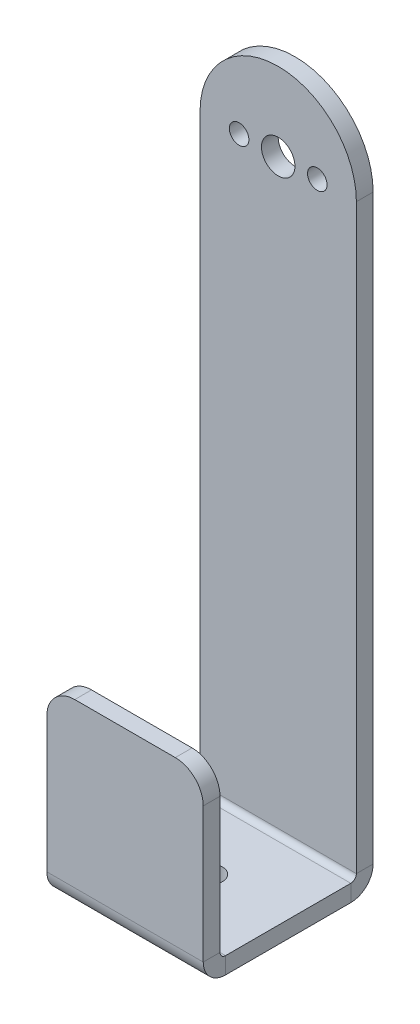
ISO-10303-21;
HEADER;
FILE_DESCRIPTION(('STEP AP214'),'2;1');
FILE_NAME('part.step','',(''),(''),'','','');
FILE_SCHEMA(('AUTOMOTIVE_DESIGN { 1 0 10303 214 1 1 1 1 }'));
ENDSEC;
DATA;
#1=APPLICATION_CONTEXT('core data for automotive mechanical design processes');
#2=APPLICATION_PROTOCOL_DEFINITION('international standard','automotive_design',2000,#1);
#3=PRODUCT_CONTEXT('',#1,'mechanical');
#4=PRODUCT('Part','Part','',(#3));
#5=PRODUCT_RELATED_PRODUCT_CATEGORY('part','',(#4));
#6=PRODUCT_DEFINITION_FORMATION('','',#4);
#7=PRODUCT_DEFINITION_CONTEXT('part definition',#1,'design');
#8=PRODUCT_DEFINITION('design','',#6,#7);
#9=PRODUCT_DEFINITION_SHAPE('','',#8);
#10=(LENGTH_UNIT() NAMED_UNIT(*) SI_UNIT(.MILLI.,.METRE.));
#11=(NAMED_UNIT(*) PLANE_ANGLE_UNIT() SI_UNIT($,.RADIAN.));
#12=(NAMED_UNIT(*) SI_UNIT($,.STERADIAN.) SOLID_ANGLE_UNIT());
#13=UNCERTAINTY_MEASURE_WITH_UNIT(LENGTH_MEASURE(1.E-05),#10,'distance_accuracy_value','');
#14=(GEOMETRIC_REPRESENTATION_CONTEXT(3) GLOBAL_UNCERTAINTY_ASSIGNED_CONTEXT((#13)) GLOBAL_UNIT_ASSIGNED_CONTEXT((#10,
#11,#12)) REPRESENTATION_CONTEXT('',''));
#15=CARTESIAN_POINT('',(0.,0.,0.));
#16=DIRECTION('',(0.,0.,1.));
#17=DIRECTION('',(1.,0.,0.));
#18=AXIS2_PLACEMENT_3D('',#15,#16,#17);
#19=CARTESIAN_POINT('',(14.,53.785421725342,-101.785421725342));
#20=DIRECTION('',(0.,1.,0.));
#21=DIRECTION('',(1.,0.,0.));
#22=AXIS2_PLACEMENT_3D('',#19,#20,#21);
#23=PLANE('',#22);
#24=CARTESIAN_POINT('',(14.,53.7854217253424,15.2145782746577));
#25=DIRECTION('',(0.,1.,0.));
#26=DIRECTION('',(1.,0.,0.));
#27=AXIS2_PLACEMENT_3D('',#24,#25,#26);
#28=CIRCLE('',#27,2.25);
#29=CARTESIAN_POINT('',(16.25,53.7854217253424,15.2145782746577));
#30=VERTEX_POINT('',#29);
#31=EDGE_CURVE('E250',#30,#30,#28,.T.);
#32=ORIENTED_EDGE('',*,*,#31,.F.);
#33=EDGE_LOOP('',(#32));
#34=FACE_BOUND('',#33,.T.);
#35=DIRECTION('',(0.,0.,1.));
#36=VECTOR('',#35,1.);
#37=CARTESIAN_POINT('',(0.,53.7854217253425,57.2145782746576));
#38=LINE('',#37,#36);
#39=CARTESIAN_POINT('',(0.,53.7854217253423,4.));
#40=VERTEX_POINT('',#39);
#41=CARTESIAN_POINT('',(0.,53.7854217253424,26.4291565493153));
#42=VERTEX_POINT('',#41);
#43=EDGE_CURVE('E280',#40,#42,#38,.T.);
#44=ORIENTED_EDGE('',*,*,#43,.T.);
#45=DIRECTION('',(1.,0.,0.));
#46=VECTOR('',#45,1.);
#47=CARTESIAN_POINT('',(14.,53.7854217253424,26.4291565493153));
#48=LINE('',#47,#46);
#49=CARTESIAN_POINT('',(28.,53.7854217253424,26.4291565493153));
#50=VERTEX_POINT('',#49);
#51=EDGE_CURVE('E179',#42,#50,#48,.T.);
#52=ORIENTED_EDGE('',*,*,#51,.T.);
#53=DIRECTION('',(0.,0.,-1.));
#54=VECTOR('',#53,1.);
#55=CARTESIAN_POINT('',(28.,53.7854217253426,57.2145782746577));
#56=LINE('',#55,#54);
#57=CARTESIAN_POINT('',(28.,53.7854217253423,4.));
#58=VERTEX_POINT('',#57);
#59=EDGE_CURVE('E260',#50,#58,#56,.T.);
#60=ORIENTED_EDGE('',*,*,#59,.T.);
#61=DIRECTION('',(-1.,0.,0.));
#62=VECTOR('',#61,1.);
#63=CARTESIAN_POINT('',(14.,53.7854217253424,4.00000000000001));
#64=LINE('',#63,#62);
#65=EDGE_CURVE('E256',#58,#40,#64,.T.);
#66=ORIENTED_EDGE('',*,*,#65,.T.);
#67=EDGE_LOOP('',(#44,#52,#60,#66));
#68=FACE_BOUND('',#67,.T.);
#69=ADVANCED_FACE('F44',(#34,#68),#23,.T.);
#70=CARTESIAN_POINT('',(14.,50.785421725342,-101.785421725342));
#71=DIRECTION('',(0.,1.,0.));
#72=DIRECTION('',(1.,0.,0.));
#73=AXIS2_PLACEMENT_3D('',#70,#71,#72);
#74=PLANE('',#73);
#75=DIRECTION('',(1.,0.,0.));
#76=VECTOR('',#75,1.);
#77=CARTESIAN_POINT('',(14.,50.7854217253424,26.4291565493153));
#78=LINE('',#77,#76);
#79=CARTESIAN_POINT('',(0.,50.7854217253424,26.4291565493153));
#80=VERTEX_POINT('',#79);
#81=CARTESIAN_POINT('',(28.,50.7854217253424,26.4291565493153));
#82=VERTEX_POINT('',#81);
#83=EDGE_CURVE('E270',#80,#82,#78,.T.);
#84=ORIENTED_EDGE('',*,*,#83,.F.);
#85=DIRECTION('',(0.,0.,1.));
#86=VECTOR('',#85,1.);
#87=CARTESIAN_POINT('',(0.,50.7854217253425,57.2145782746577));
#88=LINE('',#87,#86);
#89=CARTESIAN_POINT('',(0.,50.7854217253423,4.));
#90=VERTEX_POINT('',#89);
#91=EDGE_CURVE('E253',#90,#80,#88,.T.);
#92=ORIENTED_EDGE('',*,*,#91,.F.);
#93=DIRECTION('',(-1.,0.,0.));
#94=VECTOR('',#93,1.);
#95=CARTESIAN_POINT('',(14.,50.7854217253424,4.));
#96=LINE('',#95,#94);
#97=CARTESIAN_POINT('',(28.,50.7854217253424,4.));
#98=VERTEX_POINT('',#97);
#99=EDGE_CURVE('E262',#98,#90,#96,.T.);
#100=ORIENTED_EDGE('',*,*,#99,.F.);
#101=DIRECTION('',(0.,0.,-1.));
#102=VECTOR('',#101,1.);
#103=CARTESIAN_POINT('',(28.,50.7854217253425,57.2145782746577));
#104=LINE('',#103,#102);
#105=EDGE_CURVE('E277',#82,#98,#104,.T.);
#106=ORIENTED_EDGE('',*,*,#105,.F.);
#107=EDGE_LOOP('',(#84,#92,#100,#106));
#108=FACE_BOUND('',#107,.T.);
#109=CARTESIAN_POINT('',(14.,50.7854217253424,15.2145782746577));
#110=DIRECTION('',(0.,1.,0.));
#111=DIRECTION('',(1.,0.,0.));
#112=AXIS2_PLACEMENT_3D('',#109,#110,#111);
#113=CIRCLE('',#112,2.25);
#114=CARTESIAN_POINT('',(16.25,50.7854217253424,15.2145782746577));
#115=VERTEX_POINT('',#114);
#116=EDGE_CURVE('E204',#115,#115,#113,.T.);
#117=ORIENTED_EDGE('',*,*,#116,.T.);
#118=EDGE_LOOP('',(#117));
#119=FACE_BOUND('',#118,.T.);
#120=ADVANCED_FACE('F326',(#108,#119),#74,.F.);
#121=CARTESIAN_POINT('',(0.,53.7854217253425,57.2145782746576));
#122=DIRECTION('',(1.,0.,0.));
#123=DIRECTION('',(0.,-1.,0.));
#124=AXIS2_PLACEMENT_3D('',#121,#122,#123);
#125=PLANE('',#124);
#126=DIRECTION('',(0.,-1.,0.));
#127=VECTOR('',#126,1.);
#128=CARTESIAN_POINT('',(0.,53.7854217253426,26.4291565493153));
#129=LINE('',#128,#127);
#130=EDGE_CURVE('E268',#42,#80,#129,.T.);
#131=ORIENTED_EDGE('',*,*,#130,.F.);
#132=ORIENTED_EDGE('',*,*,#43,.F.);
#133=DIRECTION('',(0.,1.,0.));
#134=VECTOR('',#133,1.);
#135=CARTESIAN_POINT('',(0.,53.7854217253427,4.));
#136=LINE('',#135,#134);
#137=EDGE_CURVE('E264',#90,#40,#136,.T.);
#138=ORIENTED_EDGE('',*,*,#137,.F.);
#139=ORIENTED_EDGE('',*,*,#91,.T.);
#140=EDGE_LOOP('',(#131,#132,#138,#139));
#141=FACE_BOUND('',#140,.T.);
#142=ADVANCED_FACE('F334',(#141),#125,.F.);
#143=CARTESIAN_POINT('',(28.,53.7854217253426,57.2145782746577));
#144=DIRECTION('',(-1.,0.,0.));
#145=DIRECTION('',(0.,0.,1.));
#146=AXIS2_PLACEMENT_3D('',#143,#144,#145);
#147=PLANE('',#146);
#148=DIRECTION('',(0.,1.,0.));
#149=VECTOR('',#148,1.);
#150=CARTESIAN_POINT('',(28.,53.7854217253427,26.4291565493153));
#151=LINE('',#150,#149);
#152=EDGE_CURVE('E273',#82,#50,#151,.T.);
#153=ORIENTED_EDGE('',*,*,#152,.F.);
#154=ORIENTED_EDGE('',*,*,#105,.T.);
#155=DIRECTION('',(0.,-1.,0.));
#156=VECTOR('',#155,1.);
#157=CARTESIAN_POINT('',(28.,53.7854217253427,4.));
#158=LINE('',#157,#156);
#159=EDGE_CURVE('E259',#58,#98,#158,.T.);
#160=ORIENTED_EDGE('',*,*,#159,.F.);
#161=ORIENTED_EDGE('',*,*,#59,.F.);
#162=EDGE_LOOP('',(#153,#154,#160,#161));
#163=FACE_BOUND('',#162,.T.);
#164=ADVANCED_FACE('F366',(#163),#147,.F.);
#165=CARTESIAN_POINT('',(14.,53.7854217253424,15.2145782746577));
#166=DIRECTION('',(0.,-1.,0.));
#167=DIRECTION('',(-1.,0.,0.));
#168=AXIS2_PLACEMENT_3D('',#165,#166,#167);
#169=CYLINDRICAL_SURFACE('',#168,2.25);
#170=ORIENTED_EDGE('',*,*,#31,.T.);
#171=EDGE_LOOP('',(#170));
#172=FACE_BOUND('',#171,.T.);
#173=ORIENTED_EDGE('',*,*,#116,.F.);
#174=EDGE_LOOP('',(#173));
#175=FACE_BOUND('',#174,.T.);
#176=ADVANCED_FACE('F368',(#172,#175),#169,.F.);
#177=CARTESIAN_POINT('',(6.99999999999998,159.,3.));
#178=DIRECTION('',(0.,0.,-1.));
#179=DIRECTION('',(-1.,0.,0.));
#180=AXIS2_PLACEMENT_3D('',#177,#178,#179);
#181=CYLINDRICAL_SURFACE('',#180,1.75);
#182=CARTESIAN_POINT('',(6.99999999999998,159.,3.));
#183=DIRECTION('',(0.,0.,1.));
#184=DIRECTION('',(1.,0.,0.));
#185=AXIS2_PLACEMENT_3D('',#182,#183,#184);
#186=CIRCLE('',#185,1.75);
#187=CARTESIAN_POINT('',(8.74999999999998,159.,3.));
#188=VERTEX_POINT('',#187);
#189=EDGE_CURVE('E246',#188,#188,#186,.T.);
#190=ORIENTED_EDGE('',*,*,#189,.T.);
#191=EDGE_LOOP('',(#190));
#192=FACE_BOUND('',#191,.T.);
#193=CARTESIAN_POINT('',(6.99999999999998,159.,0.));
#194=DIRECTION('',(0.,0.,1.));
#195=DIRECTION('',(1.,0.,0.));
#196=AXIS2_PLACEMENT_3D('',#193,#194,#195);
#197=CIRCLE('',#196,1.75);
#198=CARTESIAN_POINT('',(8.74999999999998,159.,0.));
#199=VERTEX_POINT('',#198);
#200=EDGE_CURVE('E220',#199,#199,#197,.T.);
#201=ORIENTED_EDGE('',*,*,#200,.F.);
#202=EDGE_LOOP('',(#201));
#203=FACE_BOUND('',#202,.T.);
#204=ADVANCED_FACE('F374',(#192,#203),#181,.F.);
#205=CARTESIAN_POINT('',(14.,159.,3.));
#206=DIRECTION('',(0.,0.,-1.));
#207=DIRECTION('',(-1.,0.,0.));
#208=AXIS2_PLACEMENT_3D('',#205,#206,#207);
#209=CYLINDRICAL_SURFACE('',#208,3.);
#210=CARTESIAN_POINT('',(14.,159.,3.));
#211=DIRECTION('',(0.,0.,1.));
#212=DIRECTION('',(1.,0.,0.));
#213=AXIS2_PLACEMENT_3D('',#210,#211,#212);
#214=CIRCLE('',#213,3.);
#215=CARTESIAN_POINT('',(17.,159.,3.));
#216=VERTEX_POINT('',#215);
#217=EDGE_CURVE('E243',#216,#216,#214,.T.);
#218=ORIENTED_EDGE('',*,*,#217,.T.);
#219=EDGE_LOOP('',(#218));
#220=FACE_BOUND('',#219,.T.);
#221=CARTESIAN_POINT('',(14.,159.,0.));
#222=DIRECTION('',(0.,0.,1.));
#223=DIRECTION('',(1.,0.,0.));
#224=AXIS2_PLACEMENT_3D('',#221,#222,#223);
#225=CIRCLE('',#224,3.);
#226=CARTESIAN_POINT('',(17.,159.,0.));
#227=VERTEX_POINT('',#226);
#228=EDGE_CURVE('E217',#227,#227,#225,.T.);
#229=ORIENTED_EDGE('',*,*,#228,.F.);
#230=EDGE_LOOP('',(#229));
#231=FACE_BOUND('',#230,.T.);
#232=ADVANCED_FACE('F404',(#220,#231),#209,.F.);
#233=CARTESIAN_POINT('',(21.,159.,3.));
#234=DIRECTION('',(0.,0.,-1.));
#235=DIRECTION('',(-1.,0.,0.));
#236=AXIS2_PLACEMENT_3D('',#233,#234,#235);
#237=CYLINDRICAL_SURFACE('',#236,1.75);
#238=CARTESIAN_POINT('',(21.,159.,3.));
#239=DIRECTION('',(0.,0.,1.));
#240=DIRECTION('',(1.,0.,0.));
#241=AXIS2_PLACEMENT_3D('',#238,#239,#240);
#242=CIRCLE('',#241,1.75);
#243=CARTESIAN_POINT('',(22.75,159.,3.));
#244=VERTEX_POINT('',#243);
#245=EDGE_CURVE('E240',#244,#244,#242,.T.);
#246=ORIENTED_EDGE('',*,*,#245,.T.);
#247=EDGE_LOOP('',(#246));
#248=FACE_BOUND('',#247,.T.);
#249=CARTESIAN_POINT('',(21.,159.,0.));
#250=DIRECTION('',(0.,0.,1.));
#251=DIRECTION('',(1.,0.,0.));
#252=AXIS2_PLACEMENT_3D('',#249,#250,#251);
#253=CIRCLE('',#252,1.75);
#254=CARTESIAN_POINT('',(22.75,159.,0.));
#255=VERTEX_POINT('',#254);
#256=EDGE_CURVE('E214',#255,#255,#253,.T.);
#257=ORIENTED_EDGE('',*,*,#256,.F.);
#258=EDGE_LOOP('',(#257));
#259=FACE_BOUND('',#258,.T.);
#260=ADVANCED_FACE('F400',(#248,#259),#237,.F.);
#261=CARTESIAN_POINT('',(14.,159.,3.));
#262=DIRECTION('',(0.,0.,-1.));
#263=DIRECTION('',(-1.,0.,0.));
#264=AXIS2_PLACEMENT_3D('',#261,#262,#263);
#265=CYLINDRICAL_SURFACE('',#264,14.);
#266=CARTESIAN_POINT('',(14.,159.,0.));
#267=DIRECTION('',(0.,0.,1.));
#268=DIRECTION('',(1.,0.,0.));
#269=AXIS2_PLACEMENT_3D('',#266,#267,#268);
#270=CIRCLE('',#269,14.);
#271=CARTESIAN_POINT('',(28.,159.,0.));
#272=VERTEX_POINT('',#271);
#273=CARTESIAN_POINT('',(0.,159.,0.));
#274=VERTEX_POINT('',#273);
#275=EDGE_CURVE('E238',#272,#274,#270,.T.);
#276=ORIENTED_EDGE('',*,*,#275,.T.);
#277=DIRECTION('',(0.,0.,-1.));
#278=VECTOR('',#277,1.);
#279=CARTESIAN_POINT('',(0.,159.,3.));
#280=LINE('',#279,#278);
#281=CARTESIAN_POINT('',(0.,159.,3.));
#282=VERTEX_POINT('',#281);
#283=EDGE_CURVE('E201',#282,#274,#280,.T.);
#284=ORIENTED_EDGE('',*,*,#283,.F.);
#285=CARTESIAN_POINT('',(14.,159.,3.));
#286=DIRECTION('',(0.,0.,1.));
#287=DIRECTION('',(1.,0.,0.));
#288=AXIS2_PLACEMENT_3D('',#285,#286,#287);
#289=CIRCLE('',#288,14.);
#290=CARTESIAN_POINT('',(28.,159.,3.));
#291=VERTEX_POINT('',#290);
#292=EDGE_CURVE('E231',#291,#282,#289,.T.);
#293=ORIENTED_EDGE('',*,*,#292,.F.);
#294=DIRECTION('',(0.,0.,-1.));
#295=VECTOR('',#294,1.);
#296=CARTESIAN_POINT('',(28.,159.,3.));
#297=LINE('',#296,#295);
#298=EDGE_CURVE('E235',#291,#272,#297,.T.);
#299=ORIENTED_EDGE('',*,*,#298,.T.);
#300=EDGE_LOOP('',(#276,#284,#293,#299));
#301=FACE_BOUND('',#300,.T.);
#302=ADVANCED_FACE('F397',(#301),#265,.T.);
#303=CARTESIAN_POINT('',(14.,159.,3.));
#304=DIRECTION('',(0.,0.,1.));
#305=DIRECTION('',(1.,0.,0.));
#306=AXIS2_PLACEMENT_3D('',#303,#304,#305);
#307=PLANE('',#306);
#308=DIRECTION('',(-1.,0.,0.));
#309=VECTOR('',#308,1.);
#310=CARTESIAN_POINT('',(14.,54.7854217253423,3.));
#311=LINE('',#310,#309);
#312=CARTESIAN_POINT('',(28.,54.7854217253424,3.));
#313=VERTEX_POINT('',#312);
#314=CARTESIAN_POINT('',(0.,54.7854217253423,3.));
#315=VERTEX_POINT('',#314);
#316=EDGE_CURVE('E197',#313,#315,#311,.T.);
#317=ORIENTED_EDGE('',*,*,#316,.F.);
#318=DIRECTION('',(0.,1.,0.));
#319=VECTOR('',#318,1.);
#320=CARTESIAN_POINT('',(28.,0.,3.));
#321=LINE('',#320,#319);
#322=EDGE_CURVE('E233',#313,#291,#321,.T.);
#323=ORIENTED_EDGE('',*,*,#322,.T.);
#324=ORIENTED_EDGE('',*,*,#292,.T.);
#325=DIRECTION('',(0.,-1.,0.));
#326=VECTOR('',#325,1.);
#327=CARTESIAN_POINT('',(0.,0.,3.));
#328=LINE('',#327,#326);
#329=EDGE_CURVE('E228',#282,#315,#328,.T.);
#330=ORIENTED_EDGE('',*,*,#329,.T.);
#331=EDGE_LOOP('',(#317,#323,#324,#330));
#332=FACE_BOUND('',#331,.T.);
#333=ORIENTED_EDGE('',*,*,#245,.F.);
#334=EDGE_LOOP('',(#333));
#335=FACE_BOUND('',#334,.T.);
#336=ORIENTED_EDGE('',*,*,#217,.F.);
#337=EDGE_LOOP('',(#336));
#338=FACE_BOUND('',#337,.T.);
#339=ORIENTED_EDGE('',*,*,#189,.F.);
#340=EDGE_LOOP('',(#339));
#341=FACE_BOUND('',#340,.T.);
#342=ADVANCED_FACE('F356',(#332,#335,#338,#341),#307,.T.);
#343=CARTESIAN_POINT('',(28.,0.,3.));
#344=DIRECTION('',(-1.,0.,0.));
#345=DIRECTION('',(0.,-1.,0.));
#346=AXIS2_PLACEMENT_3D('',#343,#344,#345);
#347=PLANE('',#346);
#348=ORIENTED_EDGE('',*,*,#322,.F.);
#349=DIRECTION('',(0.,0.,-1.));
#350=VECTOR('',#349,1.);
#351=CARTESIAN_POINT('',(28.,54.7854217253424,3.00000000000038));
#352=LINE('',#351,#350);
#353=CARTESIAN_POINT('',(28.,54.7854217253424,0.));
#354=VERTEX_POINT('',#353);
#355=EDGE_CURVE('E225',#313,#354,#352,.T.);
#356=ORIENTED_EDGE('',*,*,#355,.T.);
#357=DIRECTION('',(0.,1.,0.));
#358=VECTOR('',#357,1.);
#359=CARTESIAN_POINT('',(28.,0.,0.));
#360=LINE('',#359,#358);
#361=EDGE_CURVE('E223',#354,#272,#360,.T.);
#362=ORIENTED_EDGE('',*,*,#361,.T.);
#363=ORIENTED_EDGE('',*,*,#298,.F.);
#364=EDGE_LOOP('',(#348,#356,#362,#363));
#365=FACE_BOUND('',#364,.T.);
#366=ADVANCED_FACE('F351',(#365),#347,.F.);
#367=CARTESIAN_POINT('',(14.,159.,0.));
#368=DIRECTION('',(0.,0.,1.));
#369=DIRECTION('',(1.,0.,0.));
#370=AXIS2_PLACEMENT_3D('',#367,#368,#369);
#371=PLANE('',#370);
#372=ORIENTED_EDGE('',*,*,#200,.T.);
#373=EDGE_LOOP('',(#372));
#374=FACE_BOUND('',#373,.T.);
#375=ORIENTED_EDGE('',*,*,#228,.T.);
#376=EDGE_LOOP('',(#375));
#377=FACE_BOUND('',#376,.T.);
#378=ORIENTED_EDGE('',*,*,#256,.T.);
#379=EDGE_LOOP('',(#378));
#380=FACE_BOUND('',#379,.T.);
#381=ORIENTED_EDGE('',*,*,#361,.F.);
#382=DIRECTION('',(-1.,0.,0.));
#383=VECTOR('',#382,1.);
#384=CARTESIAN_POINT('',(14.,54.7854217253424,0.));
#385=LINE('',#384,#383);
#386=CARTESIAN_POINT('',(0.,54.7854217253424,0.));
#387=VERTEX_POINT('',#386);
#388=EDGE_CURVE('E211',#354,#387,#385,.T.);
#389=ORIENTED_EDGE('',*,*,#388,.T.);
#390=DIRECTION('',(0.,-1.,0.));
#391=VECTOR('',#390,1.);
#392=CARTESIAN_POINT('',(0.,0.,0.));
#393=LINE('',#392,#391);
#394=EDGE_CURVE('E208',#274,#387,#393,.T.);
#395=ORIENTED_EDGE('',*,*,#394,.F.);
#396=ORIENTED_EDGE('',*,*,#275,.F.);
#397=EDGE_LOOP('',(#381,#389,#395,#396));
#398=FACE_BOUND('',#397,.T.);
#399=ADVANCED_FACE('F389',(#374,#377,#380,#398),#371,.F.);
#400=CARTESIAN_POINT('',(0.,0.,3.));
#401=DIRECTION('',(1.,0.,0.));
#402=DIRECTION('',(0.,0.,-1.));
#403=AXIS2_PLACEMENT_3D('',#400,#401,#402);
#404=PLANE('',#403);
#405=ORIENTED_EDGE('',*,*,#394,.T.);
#406=DIRECTION('',(0.,0.,1.));
#407=VECTOR('',#406,1.);
#408=CARTESIAN_POINT('',(0.,54.7854217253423,3.00000000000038));
#409=LINE('',#408,#407);
#410=EDGE_CURVE('E205',#387,#315,#409,.T.);
#411=ORIENTED_EDGE('',*,*,#410,.T.);
#412=ORIENTED_EDGE('',*,*,#329,.F.);
#413=ORIENTED_EDGE('',*,*,#283,.T.);
#414=EDGE_LOOP('',(#405,#411,#412,#413));
#415=FACE_BOUND('',#414,.T.);
#416=ADVANCED_FACE('F361',(#415),#404,.F.);
#417=CARTESIAN_POINT('',(28.,54.7854217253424,4.));
#418=DIRECTION('',(-1.,0.,0.));
#419=DIRECTION('',(0.,0.,1.));
#420=AXIS2_PLACEMENT_3D('',#417,#418,#419);
#421=PLANE('',#420);
#422=ORIENTED_EDGE('',*,*,#159,.T.);
#423=CARTESIAN_POINT('',(28.,54.7854217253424,4.));
#424=DIRECTION('',(1.,0.,0.));
#425=DIRECTION('',(0.,1.,0.));
#426=AXIS2_PLACEMENT_3D('',#423,#424,#425);
#427=CIRCLE('',#426,4.);
#428=EDGE_CURVE('E183',#98,#354,#427,.T.);
#429=ORIENTED_EDGE('',*,*,#428,.T.);
#430=ORIENTED_EDGE('',*,*,#355,.F.);
#431=CARTESIAN_POINT('',(28.,54.7854217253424,4.));
#432=DIRECTION('',(1.,0.,0.));
#433=DIRECTION('',(0.,0.,-1.));
#434=AXIS2_PLACEMENT_3D('',#431,#432,#433);
#435=CIRCLE('',#434,1.);
#436=EDGE_CURVE('E191',#58,#313,#435,.T.);
#437=ORIENTED_EDGE('',*,*,#436,.F.);
#438=EDGE_LOOP('',(#422,#429,#430,#437));
#439=FACE_BOUND('',#438,.T.);
#440=ADVANCED_FACE('F346',(#439),#421,.F.);
#441=CARTESIAN_POINT('',(0.,54.7854217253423,4.));
#442=DIRECTION('',(1.,0.,0.));
#443=DIRECTION('',(0.,1.,0.));
#444=AXIS2_PLACEMENT_3D('',#441,#442,#443);
#445=PLANE('',#444);
#446=CARTESIAN_POINT('',(0.,54.7854217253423,4.));
#447=DIRECTION('',(1.,0.,0.));
#448=DIRECTION('',(0.,1.,0.));
#449=AXIS2_PLACEMENT_3D('',#446,#447,#448);
#450=CIRCLE('',#449,4.);
#451=EDGE_CURVE('E195',#387,#90,#450,.F.);
#452=ORIENTED_EDGE('',*,*,#451,.T.);
#453=ORIENTED_EDGE('',*,*,#137,.T.);
#454=CARTESIAN_POINT('',(0.,54.7854217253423,4.));
#455=DIRECTION('',(-1.,0.,0.));
#456=DIRECTION('',(0.,-1.,0.));
#457=AXIS2_PLACEMENT_3D('',#454,#455,#456);
#458=CIRCLE('',#457,1.);
#459=EDGE_CURVE('E194',#315,#40,#458,.T.);
#460=ORIENTED_EDGE('',*,*,#459,.F.);
#461=ORIENTED_EDGE('',*,*,#410,.F.);
#462=EDGE_LOOP('',(#452,#453,#460,#461));
#463=FACE_BOUND('',#462,.T.);
#464=ADVANCED_FACE('F337',(#463),#445,.F.);
#465=CARTESIAN_POINT('',(-14.2040342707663,54.7854217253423,4.));
#466=DIRECTION('',(1.,0.,0.));
#467=DIRECTION('',(0.,1.,0.));
#468=AXIS2_PLACEMENT_3D('',#465,#466,#467);
#469=CYLINDRICAL_SURFACE('',#468,1.);
#470=ORIENTED_EDGE('',*,*,#316,.T.);
#471=ORIENTED_EDGE('',*,*,#459,.T.);
#472=ORIENTED_EDGE('',*,*,#65,.F.);
#473=ORIENTED_EDGE('',*,*,#436,.T.);
#474=EDGE_LOOP('',(#470,#471,#472,#473));
#475=FACE_BOUND('',#474,.T.);
#476=ADVANCED_FACE('F343',(#475),#469,.F.);
#477=CARTESIAN_POINT('',(-14.2040342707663,54.7854217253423,4.));
#478=DIRECTION('',(1.,0.,0.));
#479=DIRECTION('',(0.,1.,0.));
#480=AXIS2_PLACEMENT_3D('',#477,#478,#479);
#481=CYLINDRICAL_SURFACE('',#480,4.);
#482=ORIENTED_EDGE('',*,*,#388,.F.);
#483=ORIENTED_EDGE('',*,*,#428,.F.);
#484=ORIENTED_EDGE('',*,*,#99,.T.);
#485=ORIENTED_EDGE('',*,*,#451,.F.);
#486=EDGE_LOOP('',(#482,#483,#484,#485));
#487=FACE_BOUND('',#486,.T.);
#488=ADVANCED_FACE('F364',(#487),#481,.T.);
#489=CARTESIAN_POINT('',(0.,54.7854217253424,26.4291565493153));
#490=DIRECTION('',(1.,0.,0.));
#491=DIRECTION('',(0.,1.,0.));
#492=AXIS2_PLACEMENT_3D('',#489,#490,#491);
#493=PLANE('',#492);
#494=ORIENTED_EDGE('',*,*,#130,.T.);
#495=CARTESIAN_POINT('',(0.,54.7854217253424,26.4291565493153));
#496=DIRECTION('',(1.,0.,0.));
#497=DIRECTION('',(0.,1.,0.));
#498=AXIS2_PLACEMENT_3D('',#495,#496,#497);
#499=CIRCLE('',#498,4.);
#500=CARTESIAN_POINT('',(0.,54.7854217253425,30.4291565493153));
#501=VERTEX_POINT('',#500);
#502=EDGE_CURVE('E173',#80,#501,#499,.F.);
#503=ORIENTED_EDGE('',*,*,#502,.T.);
#504=DIRECTION('',(0.,0.,1.));
#505=VECTOR('',#504,1.);
#506=CARTESIAN_POINT('',(0.,54.7854217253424,27.4291565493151));
#507=LINE('',#506,#505);
#508=CARTESIAN_POINT('',(0.,54.7854217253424,27.4291565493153));
#509=VERTEX_POINT('',#508);
#510=EDGE_CURVE('E162',#509,#501,#507,.T.);
#511=ORIENTED_EDGE('',*,*,#510,.F.);
#512=CARTESIAN_POINT('',(0.,54.7854217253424,26.4291565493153));
#513=DIRECTION('',(-1.,0.,0.));
#514=DIRECTION('',(0.,-1.,0.));
#515=AXIS2_PLACEMENT_3D('',#512,#513,#514);
#516=CIRCLE('',#515,1.);
#517=EDGE_CURVE('E171',#42,#509,#516,.T.);
#518=ORIENTED_EDGE('',*,*,#517,.F.);
#519=EDGE_LOOP('',(#494,#503,#511,#518));
#520=FACE_BOUND('',#519,.T.);
#521=ADVANCED_FACE('F170',(#520),#493,.F.);
#522=CARTESIAN_POINT('',(28.,54.7854217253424,26.4291565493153));
#523=DIRECTION('',(-1.,0.,0.));
#524=DIRECTION('',(0.,0.,1.));
#525=AXIS2_PLACEMENT_3D('',#522,#523,#524);
#526=PLANE('',#525);
#527=CARTESIAN_POINT('',(28.,54.7854217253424,26.4291565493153));
#528=DIRECTION('',(1.,0.,0.));
#529=DIRECTION('',(0.,1.,0.));
#530=AXIS2_PLACEMENT_3D('',#527,#528,#529);
#531=CIRCLE('',#530,4.);
#532=CARTESIAN_POINT('',(28.,54.7854217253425,30.4291565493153));
#533=VERTEX_POINT('',#532);
#534=EDGE_CURVE('E181',#533,#82,#531,.T.);
#535=ORIENTED_EDGE('',*,*,#534,.T.);
#536=ORIENTED_EDGE('',*,*,#152,.T.);
#537=CARTESIAN_POINT('',(28.,54.7854217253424,26.4291565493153));
#538=DIRECTION('',(1.,0.,0.));
#539=DIRECTION('',(0.,0.,-1.));
#540=AXIS2_PLACEMENT_3D('',#537,#538,#539);
#541=CIRCLE('',#540,1.);
#542=CARTESIAN_POINT('',(28.,54.7854217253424,27.4291565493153));
#543=VERTEX_POINT('',#542);
#544=EDGE_CURVE('E180',#543,#50,#541,.T.);
#545=ORIENTED_EDGE('',*,*,#544,.F.);
#546=DIRECTION('',(0.,0.,-1.));
#547=VECTOR('',#546,1.);
#548=CARTESIAN_POINT('',(28.,54.7854217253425,27.4291565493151));
#549=LINE('',#548,#547);
#550=EDGE_CURVE('E189',#533,#543,#549,.T.);
#551=ORIENTED_EDGE('',*,*,#550,.F.);
#552=EDGE_LOOP('',(#535,#536,#545,#551));
#553=FACE_BOUND('',#552,.T.);
#554=ADVANCED_FACE('F321',(#553),#526,.F.);
#555=CARTESIAN_POINT('',(-14.2040342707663,54.7854217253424,26.4291565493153));
#556=DIRECTION('',(1.,0.,0.));
#557=DIRECTION('',(0.,1.,0.));
#558=AXIS2_PLACEMENT_3D('',#555,#556,#557);
#559=CYLINDRICAL_SURFACE('',#558,1.);
#560=DIRECTION('',(1.,0.,0.));
#561=VECTOR('',#560,1.);
#562=CARTESIAN_POINT('',(14.,54.7854217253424,27.4291565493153));
#563=LINE('',#562,#561);
#564=EDGE_CURVE('E146',#509,#543,#563,.T.);
#565=ORIENTED_EDGE('',*,*,#564,.T.);
#566=ORIENTED_EDGE('',*,*,#544,.T.);
#567=ORIENTED_EDGE('',*,*,#51,.F.);
#568=ORIENTED_EDGE('',*,*,#517,.T.);
#569=EDGE_LOOP('',(#565,#566,#567,#568));
#570=FACE_BOUND('',#569,.T.);
#571=ADVANCED_FACE('F177',(#570),#559,.F.);
#572=CARTESIAN_POINT('',(-14.2040342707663,54.7854217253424,26.4291565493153));
#573=DIRECTION('',(1.,0.,0.));
#574=DIRECTION('',(0.,1.,0.));
#575=AXIS2_PLACEMENT_3D('',#572,#573,#574);
#576=CYLINDRICAL_SURFACE('',#575,4.);
#577=DIRECTION('',(1.,0.,0.));
#578=VECTOR('',#577,1.);
#579=CARTESIAN_POINT('',(14.,54.7854217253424,30.4291565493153));
#580=LINE('',#579,#578);
#581=EDGE_CURVE('E315',#501,#533,#580,.T.);
#582=ORIENTED_EDGE('',*,*,#581,.F.);
#583=ORIENTED_EDGE('',*,*,#502,.F.);
#584=ORIENTED_EDGE('',*,*,#83,.T.);
#585=ORIENTED_EDGE('',*,*,#534,.F.);
#586=EDGE_LOOP('',(#582,#583,#584,#585));
#587=FACE_BOUND('',#586,.T.);
#588=ADVANCED_FACE('F322',(#587),#576,.T.);
#589=CARTESIAN_POINT('',(0.,84.0000000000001,27.4291565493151));
#590=DIRECTION('',(0.,-1.,0.));
#591=DIRECTION('',(0.,0.,-1.));
#592=AXIS2_PLACEMENT_3D('',#589,#590,#591);
#593=PLANE('',#592);
#594=DIRECTION('',(1.,0.,0.));
#595=VECTOR('',#594,1.);
#596=CARTESIAN_POINT('',(0.,84.0000000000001,30.4291565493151));
#597=LINE('',#596,#595);
#598=CARTESIAN_POINT('',(4.99999999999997,84.0000000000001,30.4291565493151));
#599=VERTEX_POINT('',#598);
#600=CARTESIAN_POINT('',(23.,84.0000000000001,30.4291565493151));
#601=VERTEX_POINT('',#600);
#602=EDGE_CURVE('E157',#599,#601,#597,.T.);
#603=ORIENTED_EDGE('',*,*,#602,.T.);
#604=DIRECTION('',(0.,0.,1.));
#605=VECTOR('',#604,1.);
#606=CARTESIAN_POINT('',(23.,84.0000000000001,27.4291565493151));
#607=LINE('',#606,#605);
#608=CARTESIAN_POINT('',(23.,84.0000000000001,27.4291565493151));
#609=VERTEX_POINT('',#608);
#610=EDGE_CURVE('E65',#601,#609,#607,.F.);
#611=ORIENTED_EDGE('',*,*,#610,.T.);
#612=DIRECTION('',(1.,0.,0.));
#613=VECTOR('',#612,1.);
#614=CARTESIAN_POINT('',(0.,84.0000000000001,27.4291565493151));
#615=LINE('',#614,#613);
#616=CARTESIAN_POINT('',(4.99999999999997,84.0000000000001,27.4291565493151));
#617=VERTEX_POINT('',#616);
#618=EDGE_CURVE('E164',#617,#609,#615,.T.);
#619=ORIENTED_EDGE('',*,*,#618,.F.);
#620=DIRECTION('',(0.,0.,1.));
#621=VECTOR('',#620,1.);
#622=CARTESIAN_POINT('',(4.99999999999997,84.0000000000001,27.4291565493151));
#623=LINE('',#622,#621);
#624=EDGE_CURVE('E291',#617,#599,#623,.T.);
#625=ORIENTED_EDGE('',*,*,#624,.T.);
#626=EDGE_LOOP('',(#603,#611,#619,#625));
#627=FACE_BOUND('',#626,.T.);
#628=ADVANCED_FACE('F310',(#627),#593,.F.);
#629=CARTESIAN_POINT('',(14.,-74.9999999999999,27.4291565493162));
#630=DIRECTION('',(0.,0.,-1.));
#631=DIRECTION('',(1.,0.,0.));
#632=AXIS2_PLACEMENT_3D('',#629,#630,#631);
#633=PLANE('',#632);
#634=ORIENTED_EDGE('',*,*,#618,.T.);
#635=CARTESIAN_POINT('',(23.,79.0000000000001,27.4291565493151));
#636=DIRECTION('',(0.,0.,-1.));
#637=DIRECTION('',(0.,1.,0.));
#638=AXIS2_PLACEMENT_3D('',#635,#636,#637);
#639=CIRCLE('',#638,5.);
#640=CARTESIAN_POINT('',(28.,79.0000000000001,27.4291565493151));
#641=VERTEX_POINT('',#640);
#642=EDGE_CURVE('E52',#609,#641,#639,.T.);
#643=ORIENTED_EDGE('',*,*,#642,.T.);
#644=DIRECTION('',(0.,-1.,0.));
#645=VECTOR('',#644,1.);
#646=CARTESIAN_POINT('',(28.,84.0000000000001,27.4291565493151));
#647=LINE('',#646,#645);
#648=EDGE_CURVE('E151',#641,#543,#647,.T.);
#649=ORIENTED_EDGE('',*,*,#648,.T.);
#650=ORIENTED_EDGE('',*,*,#564,.F.);
#651=DIRECTION('',(0.,1.,0.));
#652=VECTOR('',#651,1.);
#653=CARTESIAN_POINT('',(0.,84.0000000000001,27.4291565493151));
#654=LINE('',#653,#652);
#655=CARTESIAN_POINT('',(0.,79.0000000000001,27.4291565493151));
#656=VERTEX_POINT('',#655);
#657=EDGE_CURVE('E148',#509,#656,#654,.T.);
#658=ORIENTED_EDGE('',*,*,#657,.T.);
#659=CARTESIAN_POINT('',(4.99999999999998,79.0000000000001,27.4291565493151));
#660=DIRECTION('',(0.,0.,-1.));
#661=DIRECTION('',(0.,1.,0.));
#662=AXIS2_PLACEMENT_3D('',#659,#660,#661);
#663=CIRCLE('',#662,5.);
#664=EDGE_CURVE('E295',#656,#617,#663,.T.);
#665=ORIENTED_EDGE('',*,*,#664,.T.);
#666=EDGE_LOOP('',(#634,#643,#649,#650,#658,#665));
#667=FACE_BOUND('',#666,.T.);
#668=ADVANCED_FACE('F147',(#667),#633,.T.);
#669=CARTESIAN_POINT('',(0.,84.0000000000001,27.4291565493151));
#670=DIRECTION('',(1.,0.,0.));
#671=DIRECTION('',(0.,0.,1.));
#672=AXIS2_PLACEMENT_3D('',#669,#670,#671);
#673=PLANE('',#672);
#674=DIRECTION('',(0.,1.,0.));
#675=VECTOR('',#674,1.);
#676=CARTESIAN_POINT('',(0.,84.0000000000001,30.4291565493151));
#677=LINE('',#676,#675);
#678=CARTESIAN_POINT('',(0.,79.0000000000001,30.4291565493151));
#679=VERTEX_POINT('',#678);
#680=EDGE_CURVE('E174',#501,#679,#677,.T.);
#681=ORIENTED_EDGE('',*,*,#680,.T.);
#682=DIRECTION('',(0.,0.,1.));
#683=VECTOR('',#682,1.);
#684=CARTESIAN_POINT('',(0.,79.0000000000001,27.4291565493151));
#685=LINE('',#684,#683);
#686=EDGE_CURVE('E12',#679,#656,#685,.F.);
#687=ORIENTED_EDGE('',*,*,#686,.T.);
#688=ORIENTED_EDGE('',*,*,#657,.F.);
#689=ORIENTED_EDGE('',*,*,#510,.T.);
#690=EDGE_LOOP('',(#681,#687,#688,#689));
#691=FACE_BOUND('',#690,.T.);
#692=ADVANCED_FACE('F161',(#691),#673,.F.);
#693=CARTESIAN_POINT('',(14.,-74.9999999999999,30.4291565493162));
#694=DIRECTION('',(0.,0.,-1.));
#695=DIRECTION('',(1.,0.,0.));
#696=AXIS2_PLACEMENT_3D('',#693,#694,#695);
#697=PLANE('',#696);
#698=DIRECTION('',(0.,-1.,0.));
#699=VECTOR('',#698,1.);
#700=CARTESIAN_POINT('',(28.,84.0000000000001,30.4291565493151));
#701=LINE('',#700,#699);
#702=CARTESIAN_POINT('',(28.,79.0000000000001,30.4291565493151));
#703=VERTEX_POINT('',#702);
#704=EDGE_CURVE('E309',#703,#533,#701,.T.);
#705=ORIENTED_EDGE('',*,*,#704,.F.);
#706=CARTESIAN_POINT('',(23.,79.0000000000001,30.4291565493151));
#707=DIRECTION('',(0.,0.,-1.));
#708=DIRECTION('',(0.,1.,0.));
#709=AXIS2_PLACEMENT_3D('',#706,#707,#708);
#710=CIRCLE('',#709,5.);
#711=EDGE_CURVE('E289',#703,#601,#710,.F.);
#712=ORIENTED_EDGE('',*,*,#711,.T.);
#713=ORIENTED_EDGE('',*,*,#602,.F.);
#714=CARTESIAN_POINT('',(4.99999999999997,79.0000000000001,30.4291565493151));
#715=DIRECTION('',(0.,0.,-1.));
#716=DIRECTION('',(0.,1.,0.));
#717=AXIS2_PLACEMENT_3D('',#714,#715,#716);
#718=CIRCLE('',#717,5.);
#719=EDGE_CURVE('E287',#599,#679,#718,.F.);
#720=ORIENTED_EDGE('',*,*,#719,.T.);
#721=ORIENTED_EDGE('',*,*,#680,.F.);
#722=ORIENTED_EDGE('',*,*,#581,.T.);
#723=EDGE_LOOP('',(#705,#712,#713,#720,#721,#722));
#724=FACE_BOUND('',#723,.T.);
#725=ADVANCED_FACE('F307',(#724),#697,.F.);
#726=CARTESIAN_POINT('',(28.,84.0000000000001,27.4291565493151));
#727=DIRECTION('',(-1.,0.,0.));
#728=DIRECTION('',(0.,1.,0.));
#729=AXIS2_PLACEMENT_3D('',#726,#727,#728);
#730=PLANE('',#729);
#731=ORIENTED_EDGE('',*,*,#648,.F.);
#732=DIRECTION('',(0.,0.,1.));
#733=VECTOR('',#732,1.);
#734=CARTESIAN_POINT('',(28.,79.0000000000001,27.4291565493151));
#735=LINE('',#734,#733);
#736=EDGE_CURVE('E276',#641,#703,#735,.T.);
#737=ORIENTED_EDGE('',*,*,#736,.T.);
#738=ORIENTED_EDGE('',*,*,#704,.T.);
#739=ORIENTED_EDGE('',*,*,#550,.T.);
#740=EDGE_LOOP('',(#731,#737,#738,#739));
#741=FACE_BOUND('',#740,.T.);
#742=ADVANCED_FACE('F300',(#741),#730,.F.);
#743=CARTESIAN_POINT('',(23.,79.0000000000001,27.4291565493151));
#744=DIRECTION('',(0.,0.,1.));
#745=DIRECTION('',(0.,-1.,0.));
#746=AXIS2_PLACEMENT_3D('',#743,#744,#745);
#747=CYLINDRICAL_SURFACE('',#746,5.);
#748=ORIENTED_EDGE('',*,*,#642,.F.);
#749=ORIENTED_EDGE('',*,*,#610,.F.);
#750=ORIENTED_EDGE('',*,*,#711,.F.);
#751=ORIENTED_EDGE('',*,*,#736,.F.);
#752=EDGE_LOOP('',(#748,#749,#750,#751));
#753=FACE_BOUND('',#752,.T.);
#754=ADVANCED_FACE('F304',(#753),#747,.T.);
#755=CARTESIAN_POINT('',(4.99999999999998,79.0000000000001,27.4291565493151));
#756=DIRECTION('',(0.,0.,1.));
#757=DIRECTION('',(0.,-1.,0.));
#758=AXIS2_PLACEMENT_3D('',#755,#756,#757);
#759=CYLINDRICAL_SURFACE('',#758,5.);
#760=ORIENTED_EDGE('',*,*,#664,.F.);
#761=ORIENTED_EDGE('',*,*,#686,.F.);
#762=ORIENTED_EDGE('',*,*,#719,.F.);
#763=ORIENTED_EDGE('',*,*,#624,.F.);
#764=EDGE_LOOP('',(#760,#761,#762,#763));
#765=FACE_BOUND('',#764,.T.);
#766=ADVANCED_FACE('F46',(#765),#759,.T.);
#767=CLOSED_SHELL('',(#69,#120,#142,#164,#176,#204,#232,#260,#302,#342,#366,#399,#416,#440,#464,
#476,#488,#521,#554,#571,#588,#628,#668,#692,#725,#742,#754,#766));
#768=MANIFOLD_SOLID_BREP('B2',#767);
#769=ADVANCED_BREP_SHAPE_REPRESENTATION('',(#18,#768),#14);
#770=SHAPE_DEFINITION_REPRESENTATION(#9,#769);
ENDSEC;
END-ISO-10303-21;
